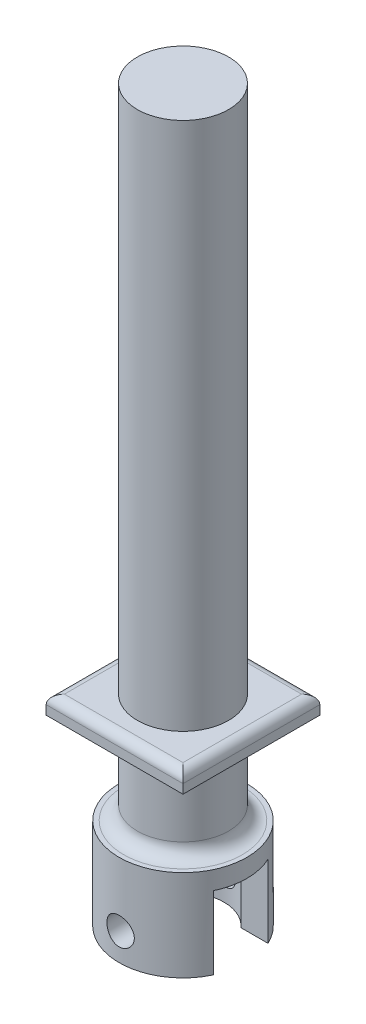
ISO-10303-21;
HEADER;
FILE_DESCRIPTION(('STEP AP214'),'2;1');
FILE_NAME('part.step','',(''),(''),'','','');
FILE_SCHEMA(('AUTOMOTIVE_DESIGN { 1 0 10303 214 1 1 1 1 }'));
ENDSEC;
DATA;
#1=APPLICATION_CONTEXT('core data for automotive mechanical design processes');
#2=APPLICATION_PROTOCOL_DEFINITION('international standard','automotive_design',2000,#1);
#3=PRODUCT_CONTEXT('',#1,'mechanical');
#4=PRODUCT('Part','Part','',(#3));
#5=PRODUCT_RELATED_PRODUCT_CATEGORY('part','',(#4));
#6=PRODUCT_DEFINITION_FORMATION('','',#4);
#7=PRODUCT_DEFINITION_CONTEXT('part definition',#1,'design');
#8=PRODUCT_DEFINITION('design','',#6,#7);
#9=PRODUCT_DEFINITION_SHAPE('','',#8);
#10=(LENGTH_UNIT() NAMED_UNIT(*) SI_UNIT(.MILLI.,.METRE.));
#11=(NAMED_UNIT(*) PLANE_ANGLE_UNIT() SI_UNIT($,.RADIAN.));
#12=(NAMED_UNIT(*) SI_UNIT($,.STERADIAN.) SOLID_ANGLE_UNIT());
#13=UNCERTAINTY_MEASURE_WITH_UNIT(LENGTH_MEASURE(1.E-05),#10,'distance_accuracy_value','');
#14=(GEOMETRIC_REPRESENTATION_CONTEXT(3) GLOBAL_UNCERTAINTY_ASSIGNED_CONTEXT((#13)) GLOBAL_UNIT_ASSIGNED_CONTEXT((#10,
#11,#12)) REPRESENTATION_CONTEXT('',''));
#15=CARTESIAN_POINT('',(0.,0.,0.));
#16=DIRECTION('',(0.,0.,1.));
#17=DIRECTION('',(1.,0.,0.));
#18=AXIS2_PLACEMENT_3D('',#15,#16,#17);
#19=CARTESIAN_POINT('',(0.,6.14499321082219,0.));
#20=DIRECTION('',(0.,-1.,0.));
#21=DIRECTION('',(0.,0.,-1.));
#22=AXIS2_PLACEMENT_3D('',#19,#20,#21);
#23=PLANE('',#22);
#24=DIRECTION('',(-1.,0.,0.));
#25=VECTOR('',#24,1.);
#26=CARTESIAN_POINT('',(-10.9357512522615,6.14499321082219,3.));
#27=LINE('',#26,#25);
#28=CARTESIAN_POINT('',(6.32455532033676,6.14499321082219,3.));
#29=VERTEX_POINT('',#28);
#30=CARTESIAN_POINT('',(3.35410196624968,6.14499321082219,3.));
#31=VERTEX_POINT('',#30);
#32=EDGE_CURVE('E555',#29,#31,#27,.T.);
#33=ORIENTED_EDGE('',*,*,#32,.F.);
#34=CARTESIAN_POINT('',(0.,6.14499321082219,0.));
#35=DIRECTION('',(0.,-1.,0.));
#36=DIRECTION('',(0.,0.,-1.));
#37=AXIS2_PLACEMENT_3D('',#34,#35,#36);
#38=CIRCLE('',#37,7.);
#39=CARTESIAN_POINT('',(-6.32455532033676,6.14499321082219,3.));
#40=VERTEX_POINT('',#39);
#41=EDGE_CURVE('E180',#29,#40,#38,.T.);
#42=ORIENTED_EDGE('',*,*,#41,.T.);
#43=CARTESIAN_POINT('',(-3.35410196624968,6.14499321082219,3.));
#44=VERTEX_POINT('',#43);
#45=EDGE_CURVE('E172',#44,#40,#27,.T.);
#46=ORIENTED_EDGE('',*,*,#45,.F.);
#47=CARTESIAN_POINT('',(0.,6.14499321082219,0.));
#48=DIRECTION('',(0.,-1.,0.));
#49=DIRECTION('',(0.,0.,-1.));
#50=AXIS2_PLACEMENT_3D('',#47,#48,#49);
#51=CIRCLE('',#50,4.5);
#52=EDGE_CURVE('E186',#31,#44,#51,.T.);
#53=ORIENTED_EDGE('',*,*,#52,.F.);
#54=EDGE_LOOP('',(#33,#42,#46,#53));
#55=FACE_BOUND('',#54,.T.);
#56=ADVANCED_FACE('F47',(#55),#23,.T.);
#57=CARTESIAN_POINT('',(0.,86.1449932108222,0.));
#58=DIRECTION('',(0.,1.,0.));
#59=DIRECTION('',(0.,0.,1.));
#60=AXIS2_PLACEMENT_3D('',#57,#58,#59);
#61=CYLINDRICAL_SURFACE('',#60,5.);
#62=CARTESIAN_POINT('',(0.,17.6449932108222,0.));
#63=DIRECTION('',(0.,-1.,0.));
#64=DIRECTION('',(0.,0.,-1.));
#65=AXIS2_PLACEMENT_3D('',#62,#63,#64);
#66=CIRCLE('',#65,5.);
#67=CARTESIAN_POINT('',(0.,17.6449932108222,-5.));
#68=VERTEX_POINT('',#67);
#69=EDGE_CURVE('E221',#68,#68,#66,.F.);
#70=ORIENTED_EDGE('',*,*,#69,.T.);
#71=EDGE_LOOP('',(#70));
#72=FACE_BOUND('',#71,.T.);
#73=CARTESIAN_POINT('',(0.,26.1449932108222,0.));
#74=DIRECTION('',(0.,1.,0.));
#75=DIRECTION('',(0.,0.,1.));
#76=AXIS2_PLACEMENT_3D('',#73,#74,#75);
#77=CIRCLE('',#76,5.);
#78=CARTESIAN_POINT('',(0.,26.1449932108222,5.));
#79=VERTEX_POINT('',#78);
#80=EDGE_CURVE('E215',#79,#79,#77,.T.);
#81=ORIENTED_EDGE('',*,*,#80,.F.);
#82=EDGE_LOOP('',(#81));
#83=FACE_BOUND('',#82,.T.);
#84=ADVANCED_FACE('F286',(#72,#83),#61,.T.);
#85=CARTESIAN_POINT('',(0.,26.1449932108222,0.));
#86=DIRECTION('',(0.,1.,0.));
#87=DIRECTION('',(0.,0.,1.));
#88=AXIS2_PLACEMENT_3D('',#85,#86,#87);
#89=PLANE('',#88);
#90=DIRECTION('',(0.,0.,-1.));
#91=VECTOR('',#90,1.);
#92=CARTESIAN_POINT('',(-7.5,26.1449932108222,7.5));
#93=LINE('',#92,#91);
#94=CARTESIAN_POINT('',(-7.5,26.1449932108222,7.5));
#95=VERTEX_POINT('',#94);
#96=CARTESIAN_POINT('',(-7.5,26.1449932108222,-7.5));
#97=VERTEX_POINT('',#96);
#98=EDGE_CURVE('E194',#95,#97,#93,.T.);
#99=ORIENTED_EDGE('',*,*,#98,.T.);
#100=DIRECTION('',(1.,0.,0.));
#101=VECTOR('',#100,1.);
#102=CARTESIAN_POINT('',(7.5,26.1449932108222,-7.5));
#103=LINE('',#102,#101);
#104=CARTESIAN_POINT('',(7.5,26.1449932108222,-7.5));
#105=VERTEX_POINT('',#104);
#106=EDGE_CURVE('E197',#97,#105,#103,.T.);
#107=ORIENTED_EDGE('',*,*,#106,.T.);
#108=DIRECTION('',(0.,0.,1.));
#109=VECTOR('',#108,1.);
#110=CARTESIAN_POINT('',(7.5,26.1449932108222,7.5));
#111=LINE('',#110,#109);
#112=CARTESIAN_POINT('',(7.5,26.1449932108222,7.5));
#113=VERTEX_POINT('',#112);
#114=EDGE_CURVE('E199',#105,#113,#111,.T.);
#115=ORIENTED_EDGE('',*,*,#114,.T.);
#116=DIRECTION('',(-1.,0.,0.));
#117=VECTOR('',#116,1.);
#118=CARTESIAN_POINT('',(7.5,26.1449932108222,7.5));
#119=LINE('',#118,#117);
#120=EDGE_CURVE('E201',#113,#95,#119,.T.);
#121=ORIENTED_EDGE('',*,*,#120,.T.);
#122=EDGE_LOOP('',(#99,#107,#115,#121));
#123=FACE_BOUND('',#122,.T.);
#124=ORIENTED_EDGE('',*,*,#80,.T.);
#125=EDGE_LOOP('',(#124));
#126=FACE_BOUND('',#125,.T.);
#127=ADVANCED_FACE('F281',(#123,#126),#89,.F.);
#128=CARTESIAN_POINT('',(0.,28.1449932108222,0.));
#129=DIRECTION('',(0.,1.,0.));
#130=DIRECTION('',(0.,0.,1.));
#131=AXIS2_PLACEMENT_3D('',#128,#129,#130);
#132=PLANE('',#131);
#133=DIRECTION('',(1.,0.,0.));
#134=VECTOR('',#133,1.);
#135=CARTESIAN_POINT('',(-7.5,28.1449932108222,-6.5));
#136=LINE('',#135,#134);
#137=CARTESIAN_POINT('',(6.5,28.1449932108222,-6.5));
#138=VERTEX_POINT('',#137);
#139=CARTESIAN_POINT('',(-6.5,28.1449932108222,-6.5));
#140=VERTEX_POINT('',#139);
#141=EDGE_CURVE('E601',#138,#140,#136,.F.);
#142=ORIENTED_EDGE('',*,*,#141,.T.);
#143=DIRECTION('',(0.,0.,-1.));
#144=VECTOR('',#143,1.);
#145=CARTESIAN_POINT('',(-6.5,28.1449932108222,7.5));
#146=LINE('',#145,#144);
#147=CARTESIAN_POINT('',(-6.5,28.1449932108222,6.5));
#148=VERTEX_POINT('',#147);
#149=EDGE_CURVE('E599',#140,#148,#146,.F.);
#150=ORIENTED_EDGE('',*,*,#149,.T.);
#151=DIRECTION('',(-1.,0.,0.));
#152=VECTOR('',#151,1.);
#153=CARTESIAN_POINT('',(7.5,28.1449932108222,6.5));
#154=LINE('',#153,#152);
#155=CARTESIAN_POINT('',(6.5,28.1449932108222,6.5));
#156=VERTEX_POINT('',#155);
#157=EDGE_CURVE('E585',#148,#156,#154,.F.);
#158=ORIENTED_EDGE('',*,*,#157,.T.);
#159=DIRECTION('',(0.,0.,1.));
#160=VECTOR('',#159,1.);
#161=CARTESIAN_POINT('',(6.5,28.1449932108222,-7.5));
#162=LINE('',#161,#160);
#163=EDGE_CURVE('E603',#156,#138,#162,.F.);
#164=ORIENTED_EDGE('',*,*,#163,.T.);
#165=EDGE_LOOP('',(#142,#150,#158,#164));
#166=FACE_BOUND('',#165,.T.);
#167=CARTESIAN_POINT('',(0.,28.1449932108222,0.));
#168=DIRECTION('',(0.,-1.,0.));
#169=DIRECTION('',(0.,0.,-1.));
#170=AXIS2_PLACEMENT_3D('',#167,#168,#169);
#171=CIRCLE('',#170,5.00000000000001);
#172=CARTESIAN_POINT('',(0.,28.1449932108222,-5.00000000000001));
#173=VERTEX_POINT('',#172);
#174=EDGE_CURVE('E184',#173,#173,#171,.T.);
#175=ORIENTED_EDGE('',*,*,#174,.T.);
#176=EDGE_LOOP('',(#175));
#177=FACE_BOUND('',#176,.T.);
#178=ADVANCED_FACE('F285',(#166,#177),#132,.T.);
#179=CARTESIAN_POINT('',(-7.5,26.1449932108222,7.5));
#180=DIRECTION('',(1.,0.,0.));
#181=DIRECTION('',(0.,0.,-1.));
#182=AXIS2_PLACEMENT_3D('',#179,#180,#181);
#183=PLANE('',#182);
#184=DIRECTION('',(0.,1.,0.));
#185=VECTOR('',#184,1.);
#186=CARTESIAN_POINT('',(-7.5,26.1449932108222,7.5));
#187=LINE('',#186,#185);
#188=CARTESIAN_POINT('',(-7.5,27.1449932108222,7.5));
#189=VERTEX_POINT('',#188);
#190=EDGE_CURVE('E203',#95,#189,#187,.T.);
#191=ORIENTED_EDGE('',*,*,#190,.T.);
#192=DIRECTION('',(0.,0.,-1.));
#193=VECTOR('',#192,1.);
#194=CARTESIAN_POINT('',(-7.5,27.1449932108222,-7.5));
#195=LINE('',#194,#193);
#196=CARTESIAN_POINT('',(-7.5,27.1449932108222,-7.5));
#197=VERTEX_POINT('',#196);
#198=EDGE_CURVE('E237',#189,#197,#195,.T.);
#199=ORIENTED_EDGE('',*,*,#198,.T.);
#200=DIRECTION('',(0.,1.,0.));
#201=VECTOR('',#200,1.);
#202=CARTESIAN_POINT('',(-7.5,26.1449932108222,-7.5));
#203=LINE('',#202,#201);
#204=EDGE_CURVE('E210',#97,#197,#203,.T.);
#205=ORIENTED_EDGE('',*,*,#204,.F.);
#206=ORIENTED_EDGE('',*,*,#98,.F.);
#207=EDGE_LOOP('',(#191,#199,#205,#206));
#208=FACE_BOUND('',#207,.T.);
#209=ADVANCED_FACE('F290',(#208),#183,.F.);
#210=CARTESIAN_POINT('',(7.5,26.1449932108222,-7.5));
#211=DIRECTION('',(0.,0.,1.));
#212=DIRECTION('',(1.,0.,0.));
#213=AXIS2_PLACEMENT_3D('',#210,#211,#212);
#214=PLANE('',#213);
#215=ORIENTED_EDGE('',*,*,#204,.T.);
#216=DIRECTION('',(1.,0.,0.));
#217=VECTOR('',#216,1.);
#218=CARTESIAN_POINT('',(7.5,27.1449932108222,-7.5));
#219=LINE('',#218,#217);
#220=CARTESIAN_POINT('',(7.5,27.1449932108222,-7.5));
#221=VERTEX_POINT('',#220);
#222=EDGE_CURVE('E71',#197,#221,#219,.T.);
#223=ORIENTED_EDGE('',*,*,#222,.T.);
#224=DIRECTION('',(0.,1.,0.));
#225=VECTOR('',#224,1.);
#226=CARTESIAN_POINT('',(7.5,26.1449932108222,-7.5));
#227=LINE('',#226,#225);
#228=EDGE_CURVE('E208',#105,#221,#227,.T.);
#229=ORIENTED_EDGE('',*,*,#228,.F.);
#230=ORIENTED_EDGE('',*,*,#106,.F.);
#231=EDGE_LOOP('',(#215,#223,#229,#230));
#232=FACE_BOUND('',#231,.T.);
#233=ADVANCED_FACE('F300',(#232),#214,.F.);
#234=CARTESIAN_POINT('',(7.5,26.1449932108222,7.5));
#235=DIRECTION('',(-1.,0.,0.));
#236=DIRECTION('',(0.,0.,1.));
#237=AXIS2_PLACEMENT_3D('',#234,#235,#236);
#238=PLANE('',#237);
#239=ORIENTED_EDGE('',*,*,#228,.T.);
#240=DIRECTION('',(0.,0.,1.));
#241=VECTOR('',#240,1.);
#242=CARTESIAN_POINT('',(7.5,27.1449932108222,7.5));
#243=LINE('',#242,#241);
#244=CARTESIAN_POINT('',(7.5,27.1449932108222,7.5));
#245=VERTEX_POINT('',#244);
#246=EDGE_CURVE('E56',#221,#245,#243,.T.);
#247=ORIENTED_EDGE('',*,*,#246,.T.);
#248=DIRECTION('',(0.,1.,0.));
#249=VECTOR('',#248,1.);
#250=CARTESIAN_POINT('',(7.5,26.1449932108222,7.5));
#251=LINE('',#250,#249);
#252=EDGE_CURVE('E206',#113,#245,#251,.T.);
#253=ORIENTED_EDGE('',*,*,#252,.F.);
#254=ORIENTED_EDGE('',*,*,#114,.F.);
#255=EDGE_LOOP('',(#239,#247,#253,#254));
#256=FACE_BOUND('',#255,.T.);
#257=ADVANCED_FACE('F296',(#256),#238,.F.);
#258=CARTESIAN_POINT('',(7.5,26.1449932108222,7.5));
#259=DIRECTION('',(0.,0.,-1.));
#260=DIRECTION('',(-1.,0.,0.));
#261=AXIS2_PLACEMENT_3D('',#258,#259,#260);
#262=PLANE('',#261);
#263=ORIENTED_EDGE('',*,*,#252,.T.);
#264=DIRECTION('',(-1.,0.,0.));
#265=VECTOR('',#264,1.);
#266=CARTESIAN_POINT('',(-7.5,27.1449932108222,7.5));
#267=LINE('',#266,#265);
#268=EDGE_CURVE('E12',#245,#189,#267,.T.);
#269=ORIENTED_EDGE('',*,*,#268,.T.);
#270=ORIENTED_EDGE('',*,*,#190,.F.);
#271=ORIENTED_EDGE('',*,*,#120,.F.);
#272=EDGE_LOOP('',(#263,#269,#270,#271));
#273=FACE_BOUND('',#272,.T.);
#274=ADVANCED_FACE('F292',(#273),#262,.F.);
#275=CARTESIAN_POINT('',(5.,86.1449932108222,0.));
#276=DIRECTION('',(0.,-1.,0.));
#277=DIRECTION('',(0.,0.,-1.));
#278=AXIS2_PLACEMENT_3D('',#275,#276,#277);
#279=PLANE('',#278);
#280=CARTESIAN_POINT('',(0.,86.1449932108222,0.));
#281=DIRECTION('',(0.,1.,0.));
#282=DIRECTION('',(0.,0.,1.));
#283=AXIS2_PLACEMENT_3D('',#280,#281,#282);
#284=CIRCLE('',#283,5.);
#285=CARTESIAN_POINT('',(0.,86.1449932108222,5.));
#286=VERTEX_POINT('',#285);
#287=EDGE_CURVE('E212',#286,#286,#284,.T.);
#288=ORIENTED_EDGE('',*,*,#287,.T.);
#289=EDGE_LOOP('',(#288));
#290=FACE_BOUND('',#289,.T.);
#291=ADVANCED_FACE('F295',(#290),#279,.F.);
#292=ORIENTED_EDGE('',*,*,#174,.F.);
#293=EDGE_LOOP('',(#292));
#294=FACE_BOUND('',#293,.T.);
#295=ORIENTED_EDGE('',*,*,#287,.F.);
#296=EDGE_LOOP('',(#295));
#297=FACE_BOUND('',#296,.T.);
#298=ADVANCED_FACE('F306',(#294,#297),#61,.T.);
#299=CARTESIAN_POINT('',(0.,16.1449932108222,0.));
#300=DIRECTION('',(0.,-1.,0.));
#301=DIRECTION('',(0.,0.,-1.));
#302=AXIS2_PLACEMENT_3D('',#299,#300,#301);
#303=PLANE('',#302);
#304=CARTESIAN_POINT('',(0.,16.1449932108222,0.));
#305=DIRECTION('',(0.,-1.,0.));
#306=DIRECTION('',(0.,0.,-1.));
#307=AXIS2_PLACEMENT_3D('',#304,#305,#306);
#308=CIRCLE('',#307,6.5);
#309=CARTESIAN_POINT('',(0.,16.1449932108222,-6.5));
#310=VERTEX_POINT('',#309);
#311=EDGE_CURVE('E218',#310,#310,#308,.T.);
#312=ORIENTED_EDGE('',*,*,#311,.T.);
#313=EDGE_LOOP('',(#312));
#314=FACE_BOUND('',#313,.T.);
#315=CARTESIAN_POINT('',(0.,16.1449932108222,0.));
#316=DIRECTION('',(0.,-1.,0.));
#317=DIRECTION('',(0.,0.,-1.));
#318=AXIS2_PLACEMENT_3D('',#315,#316,#317);
#319=CIRCLE('',#318,7.);
#320=CARTESIAN_POINT('',(0.,16.1449932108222,-7.));
#321=VERTEX_POINT('',#320);
#322=EDGE_CURVE('E181',#321,#321,#319,.T.);
#323=ORIENTED_EDGE('',*,*,#322,.F.);
#324=EDGE_LOOP('',(#323));
#325=FACE_BOUND('',#324,.T.);
#326=ADVANCED_FACE('F280',(#314,#325),#303,.F.);
#327=DIRECTION('',(1.,0.,0.));
#328=VECTOR('',#327,1.);
#329=CARTESIAN_POINT('',(-10.9357512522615,6.14499321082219,-3.));
#330=LINE('',#329,#328);
#331=CARTESIAN_POINT('',(-6.32455532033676,6.14499321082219,-3.));
#332=VERTEX_POINT('',#331);
#333=CARTESIAN_POINT('',(-3.35410196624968,6.14499321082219,-3.));
#334=VERTEX_POINT('',#333);
#335=EDGE_CURVE('E155',#332,#334,#330,.T.);
#336=ORIENTED_EDGE('',*,*,#335,.F.);
#337=CARTESIAN_POINT('',(6.32455532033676,6.14499321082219,-3.));
#338=VERTEX_POINT('',#337);
#339=EDGE_CURVE('E169',#332,#338,#38,.T.);
#340=ORIENTED_EDGE('',*,*,#339,.T.);
#341=CARTESIAN_POINT('',(3.35410196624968,6.14499321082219,-3.));
#342=VERTEX_POINT('',#341);
#343=EDGE_CURVE('E173',#342,#338,#330,.T.);
#344=ORIENTED_EDGE('',*,*,#343,.F.);
#345=EDGE_CURVE('E171',#334,#342,#51,.T.);
#346=ORIENTED_EDGE('',*,*,#345,.F.);
#347=EDGE_LOOP('',(#336,#340,#344,#346));
#348=FACE_BOUND('',#347,.T.);
#349=ADVANCED_FACE('F167',(#348),#23,.T.);
#350=CARTESIAN_POINT('',(0.,6.14499321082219,0.));
#351=DIRECTION('',(0.,1.,0.));
#352=DIRECTION('',(0.,0.,1.));
#353=AXIS2_PLACEMENT_3D('',#350,#351,#352);
#354=CYLINDRICAL_SURFACE('',#353,7.);
#355=CARTESIAN_POINT('',(0.,7.64499321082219,7.));
#356=CARTESIAN_POINT('',(-0.0832358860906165,7.64499611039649,6.99999846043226));
#357=CARTESIAN_POINT('',(-0.166507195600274,7.65194481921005,6.99850025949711));
#358=CARTESIAN_POINT('',(-0.330687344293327,7.67952886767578,6.99266829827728));
#359=CARTESIAN_POINT('',(-0.41159440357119,7.70017425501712,6.988332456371));
#360=CARTESIAN_POINT('',(-0.568649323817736,7.75447757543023,6.97730831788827));
#361=CARTESIAN_POINT('',(-0.644801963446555,7.78812219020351,6.97062242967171));
#362=CARTESIAN_POINT('',(-0.790378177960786,7.86742729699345,6.95562106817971));
#363=CARTESIAN_POINT('',(-0.859801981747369,7.91308738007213,6.94730565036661));
#364=CARTESIAN_POINT('',(-0.991024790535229,8.0158735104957,6.92981369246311));
#365=CARTESIAN_POINT('',(-1.05270503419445,8.07314943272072,6.92062683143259));
#366=CARTESIAN_POINT('',(-1.16566042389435,8.19721952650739,6.90250069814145));
#367=CARTESIAN_POINT('',(-1.21693467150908,8.26401451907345,6.8935614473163));
#368=CARTESIAN_POINT('',(-1.30814204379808,8.40609896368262,6.87684116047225));
#369=CARTESIAN_POINT('',(-1.34794958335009,8.4814707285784,6.8690733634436));
#370=CARTESIAN_POINT('',(-1.41428823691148,8.63802766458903,6.85572325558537));
#371=CARTESIAN_POINT('',(-1.44082087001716,8.71921216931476,6.85014069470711));
#372=CARTESIAN_POINT('',(-1.47946574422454,8.88380429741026,6.84189808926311));
#373=CARTESIAN_POINT('',(-1.49178779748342,8.96716048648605,6.83919556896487));
#374=CARTESIAN_POINT('',(-1.50231395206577,9.13479744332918,6.83689139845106));
#375=CARTESIAN_POINT('',(-1.50051971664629,9.21907810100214,6.83728938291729));
#376=CARTESIAN_POINT('',(-1.48303326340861,9.38461789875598,6.84110276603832));
#377=CARTESIAN_POINT('',(-1.46758398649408,9.46590409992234,6.84446541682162));
#378=CARTESIAN_POINT('',(-1.42361054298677,9.62470345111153,6.85374593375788));
#379=CARTESIAN_POINT('',(-1.39508566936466,9.70221639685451,6.85966393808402));
#380=CARTESIAN_POINT('',(-1.32554551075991,9.85195608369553,6.87344080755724));
#381=CARTESIAN_POINT('',(-1.2844361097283,9.92413772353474,6.88131420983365));
#382=CARTESIAN_POINT('',(-1.19096007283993,10.0606683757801,6.89810572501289));
#383=CARTESIAN_POINT('',(-1.13859196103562,10.1250163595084,6.90702397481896));
#384=CARTESIAN_POINT('',(-1.0227954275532,10.2454525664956,6.92512718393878));
#385=CARTESIAN_POINT('',(-0.959160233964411,10.3013419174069,6.93431383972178));
#386=CARTESIAN_POINT('',(-0.823317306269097,10.4016869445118,6.9517501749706));
#387=CARTESIAN_POINT('',(-0.751109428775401,10.4461424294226,6.95999983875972));
#388=CARTESIAN_POINT('',(-0.59993346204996,10.5224038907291,6.97465778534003));
#389=CARTESIAN_POINT('',(-0.520952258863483,10.5541846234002,6.98106238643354));
#390=CARTESIAN_POINT('',(-0.358603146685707,10.6039688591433,6.99128109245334));
#391=CARTESIAN_POINT('',(-0.27523585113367,10.6219742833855,6.99509555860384));
#392=CARTESIAN_POINT('',(-0.10818767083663,10.6434094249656,6.99965306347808));
#393=CARTESIAN_POINT('',(-0.0245431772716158,10.647110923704,7.00045336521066));
#394=CARTESIAN_POINT('',(0.142168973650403,10.640568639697,6.9990524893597));
#395=CARTESIAN_POINT('',(0.225236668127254,10.6303257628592,6.99685150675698));
#396=CARTESIAN_POINT('',(0.387542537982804,10.5964109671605,6.98973143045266));
#397=CARTESIAN_POINT('',(0.466811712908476,10.5728808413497,6.9848410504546));
#398=CARTESIAN_POINT('',(0.620278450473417,10.5132162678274,6.9728892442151));
#399=CARTESIAN_POINT('',(0.694475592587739,10.4770807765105,6.96582763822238));
#400=CARTESIAN_POINT('',(0.836821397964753,10.3926596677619,6.950175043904));
#401=CARTESIAN_POINT('',(0.90487257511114,10.3442134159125,6.94156431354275));
#402=CARTESIAN_POINT('',(1.03197692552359,10.2367583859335,6.92381033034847));
#403=CARTESIAN_POINT('',(1.091028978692,10.1777482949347,6.91466701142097));
#404=CARTESIAN_POINT('',(1.19952711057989,10.0495958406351,6.89668172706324));
#405=CARTESIAN_POINT('',(1.24878537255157,9.98029311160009,6.88784792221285));
#406=CARTESIAN_POINT('',(1.3349641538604,9.8342386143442,6.87166654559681));
#407=CARTESIAN_POINT('',(1.37188519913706,9.7574871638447,6.86431891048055));
#408=CARTESIAN_POINT('',(1.43209741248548,9.59912091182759,6.85201009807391));
#409=CARTESIAN_POINT('',(1.45546398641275,9.51753585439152,6.84703574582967));
#410=CARTESIAN_POINT('',(1.48812696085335,9.35147762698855,6.84001186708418));
#411=CARTESIAN_POINT('',(1.49742550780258,9.26700489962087,6.83796189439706));
#412=CARTESIAN_POINT('',(1.5015999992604,9.09946086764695,6.83704618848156));
#413=CARTESIAN_POINT('',(1.49677347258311,9.01639719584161,6.83811476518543));
#414=CARTESIAN_POINT('',(1.47349789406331,8.8522959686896,6.84316763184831));
#415=CARTESIAN_POINT('',(1.45504898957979,8.77125839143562,6.84715189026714));
#416=CARTESIAN_POINT('',(1.40519345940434,8.61373455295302,6.85755581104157));
#417=CARTESIAN_POINT('',(1.37382847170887,8.5372345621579,6.86396764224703));
#418=CARTESIAN_POINT('',(1.29906751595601,8.39053783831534,6.87850764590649));
#419=CARTESIAN_POINT('',(1.255670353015,8.32034173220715,6.88663598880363));
#420=CARTESIAN_POINT('',(1.15708290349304,8.18677501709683,6.90389055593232));
#421=CARTESIAN_POINT('',(1.10167987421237,8.12356351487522,6.91303309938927));
#422=CARTESIAN_POINT('',(0.981086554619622,8.00723694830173,6.93117449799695));
#423=CARTESIAN_POINT('',(0.915894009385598,7.95412421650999,6.94017331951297));
#424=CARTESIAN_POINT('',(0.776603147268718,7.85887725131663,6.95714491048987));
#425=CARTESIAN_POINT('',(0.702404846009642,7.81688660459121,6.96510364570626));
#426=CARTESIAN_POINT('',(0.547850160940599,7.74603868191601,6.97895826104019));
#427=CARTESIAN_POINT('',(0.467499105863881,7.71717018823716,6.98485590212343));
#428=CARTESIAN_POINT('',(0.322535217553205,7.67864102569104,6.99284848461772));
#429=CARTESIAN_POINT('',(0.25871720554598,7.66604677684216,6.99551391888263));
#430=CARTESIAN_POINT('',(0.129939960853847,7.64922190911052,6.9990902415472));
#431=CARTESIAN_POINT('',(0.0649807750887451,7.64499094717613,7.00000120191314));
#432=CARTESIAN_POINT('',(0.,7.64499321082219,7.));
#433=B_SPLINE_CURVE_WITH_KNOTS('',3,(#355,#356,#357,#358,#359,#360,#361,#362,#363,#364,#365,
#366,#367,#368,#369,#370,#371,#372,#373,#374,#375,#376,#377,#378,#379,#380,#381,#382,#383,#384,
#385,#386,#387,#388,#389,#390,#391,#392,#393,#394,#395,#396,#397,#398,#399,#400,#401,#402,#403,
#404,#405,#406,#407,#408,#409,#410,#411,#412,#413,#414,#415,#416,#417,#418,#419,#420,#421,#422,
#423,#424,#425,#426,#427,#428,#429,#430,#431,#432),.UNSPECIFIED.,.T.,.F.,(4,2,2,2,2,2,2,2,2,2,2,
2,2,2,2,2,2,2,2,2,2,2,2,2,2,2,2,2,2,2,2,2,2,2,2,2,2,2,4),(0.,0.249469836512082,
0.499122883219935,0.748520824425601,0.997910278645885,1.25074961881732,1.50361077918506,
1.7591442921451,2.0146485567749,2.26633008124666,2.51798195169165,2.76524475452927,
3.01252092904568,3.26169356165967,3.51089887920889,3.76527011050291,4.0196455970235,
4.27452521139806,4.52936927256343,4.77934665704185,5.02930780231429,5.27665060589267,
5.52401389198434,5.77478733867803,6.02559197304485,6.28082063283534,6.53603841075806,
6.78982240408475,7.04356767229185,7.29200680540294,7.5404432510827,7.78808499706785,
8.03575134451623,8.28822950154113,8.54076590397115,8.79641910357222,9.05185334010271,
9.24661799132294,9.44137465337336),.UNSPECIFIED.);
#434=CARTESIAN_POINT('',(0.,7.64499321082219,7.));
#435=VERTEX_POINT('',#434);
#436=EDGE_CURVE('E271',#435,#435,#433,.T.);
#437=ORIENTED_EDGE('',*,*,#436,.T.);
#438=EDGE_LOOP('',(#437));
#439=FACE_BOUND('',#438,.T.);
#440=CARTESIAN_POINT('',(1.5,9.14499321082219,-6.83739716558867));
#441=CARTESIAN_POINT('',(1.49999708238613,9.22820436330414,-6.83739884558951));
#442=CARTESIAN_POINT('',(1.49305236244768,9.31145098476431,-6.83893272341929));
#443=CARTESIAN_POINT('',(1.46548559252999,9.4755798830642,-6.84489178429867));
#444=CARTESIAN_POINT('',(1.44485339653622,9.5564603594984,-6.84931911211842));
#445=CARTESIAN_POINT('',(1.39058863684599,9.71345896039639,-6.86054115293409));
#446=CARTESIAN_POINT('',(1.35697000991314,9.78958208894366,-6.86733332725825));
#447=CARTESIAN_POINT('',(1.27772617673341,9.9351084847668,-6.88251670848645));
#448=CARTESIAN_POINT('',(1.23210132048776,10.0045119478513,-6.89090786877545));
#449=CARTESIAN_POINT('',(1.12935142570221,10.1357561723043,-6.90849578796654));
#450=CARTESIAN_POINT('',(1.07206859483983,10.1974720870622,-6.91770249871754));
#451=CARTESIAN_POINT('',(0.947969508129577,10.310496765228,-6.93579691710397));
#452=CARTESIAN_POINT('',(0.881152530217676,10.3618047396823,-6.94468460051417));
#453=CARTESIAN_POINT('',(0.739047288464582,10.4530486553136,-6.96124769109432));
#454=CARTESIAN_POINT('',(0.663680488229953,10.4928648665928,-6.96890998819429));
#455=CARTESIAN_POINT('',(0.507134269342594,10.5592209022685,-6.98204671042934));
#456=CARTESIAN_POINT('',(0.425955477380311,10.5857621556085,-6.98752137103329));
#457=CARTESIAN_POINT('',(0.261387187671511,10.6244231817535,-6.99559565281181));
#458=CARTESIAN_POINT('',(0.178049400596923,10.6367541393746,-6.99823733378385));
#459=CARTESIAN_POINT('',(0.0104489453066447,10.6473044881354,-7.00049362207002));
#460=CARTESIAN_POINT('',(-0.0738136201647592,10.6455254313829,-7.00010856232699));
#461=CARTESIAN_POINT('',(-0.239417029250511,10.6280642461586,-6.99638700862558));
#462=CARTESIAN_POINT('',(-0.320783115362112,10.6126097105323,-6.99309883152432));
#463=CARTESIAN_POINT('',(-0.479739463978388,10.5685985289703,-6.98399541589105));
#464=CARTESIAN_POINT('',(-0.557329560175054,10.5400413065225,-6.97818006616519));
#465=CARTESIAN_POINT('',(-0.707167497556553,10.4704317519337,-6.96459754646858));
#466=CARTESIAN_POINT('',(-0.779373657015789,10.4292924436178,-6.95681685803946));
#467=CARTESIAN_POINT('',(-0.915940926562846,10.3357512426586,-6.94015793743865));
#468=CARTESIAN_POINT('',(-0.980301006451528,10.2833478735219,-6.93127956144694));
#469=CARTESIAN_POINT('',(-1.10070208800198,10.1675246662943,-6.91319326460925));
#470=CARTESIAN_POINT('',(-1.1565511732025,10.1039056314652,-6.90398230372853));
#471=CARTESIAN_POINT('',(-1.25682243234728,9.96810992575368,-6.88643566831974));
#472=CARTESIAN_POINT('',(-1.30124432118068,9.89593304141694,-6.87810001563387));
#473=CARTESIAN_POINT('',(-1.37748077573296,9.74476870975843,-6.86324023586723));
#474=CARTESIAN_POINT('',(-1.40926035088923,9.66576308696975,-6.85672115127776));
#475=CARTESIAN_POINT('',(-1.45903495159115,9.50336044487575,-6.84630340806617));
#476=CARTESIAN_POINT('',(-1.47703206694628,9.419964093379,-6.84240435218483));
#477=CARTESIAN_POINT('',(-1.49843586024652,9.25289745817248,-6.83774881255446));
#478=CARTESIAN_POINT('',(-1.5021214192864,9.16926453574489,-6.83693227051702));
#479=CARTESIAN_POINT('',(-1.49555139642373,9.0025792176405,-6.83837239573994));
#480=CARTESIAN_POINT('',(-1.48529673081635,8.91952678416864,-6.84062886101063));
#481=CARTESIAN_POINT('',(-1.45137894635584,8.75732277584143,-6.84790415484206));
#482=CARTESIAN_POINT('',(-1.42786830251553,8.67813777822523,-6.85289155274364));
#483=CARTESIAN_POINT('',(-1.36827052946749,8.52483087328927,-6.86503859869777));
#484=CARTESIAN_POINT('',(-1.33218223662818,8.450709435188,-6.87219844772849));
#485=CARTESIAN_POINT('',(-1.24783504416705,8.30842352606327,-6.88801634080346));
#486=CARTESIAN_POINT('',(-1.19940368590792,8.24036362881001,-6.89669501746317));
#487=CARTESIAN_POINT('',(-1.09197183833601,8.11323486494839,-6.91451775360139));
#488=CARTESIAN_POINT('',(-1.03297009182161,8.05416706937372,-6.92366186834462));
#489=CARTESIAN_POINT('',(-0.904812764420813,7.94562290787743,-6.94158239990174));
#490=CARTESIAN_POINT('',(-0.83549492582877,7.89633629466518,-6.95034935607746));
#491=CARTESIAN_POINT('',(-0.689401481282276,7.81010780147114,-6.96635610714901));
#492=CARTESIAN_POINT('',(-0.61262621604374,7.77316535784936,-6.97359597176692));
#493=CARTESIAN_POINT('',(-0.454265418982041,7.71294115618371,-6.98569278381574));
#494=CARTESIAN_POINT('',(-0.372713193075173,7.68957490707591,-6.99056443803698));
#495=CARTESIAN_POINT('',(-0.20672517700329,7.65690150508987,-6.99743939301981));
#496=CARTESIAN_POINT('',(-0.122289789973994,7.64759239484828,-6.99944309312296));
#497=CARTESIAN_POINT('',(0.0452637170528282,7.64338255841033,-7.00034511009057));
#498=CARTESIAN_POINT('',(0.128374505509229,7.64819805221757,-6.99930459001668));
#499=CARTESIAN_POINT('',(0.29257293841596,7.67146797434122,-6.99436552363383));
#500=CARTESIAN_POINT('',(0.373660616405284,7.68992217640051,-6.99046702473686));
#501=CARTESIAN_POINT('',(0.531301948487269,7.73981201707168,-6.98025388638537));
#502=CARTESIAN_POINT('',(0.607868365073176,7.77120890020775,-6.97394646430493));
#503=CARTESIAN_POINT('',(0.754684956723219,7.84605448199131,-6.95959036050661));
#504=CARTESIAN_POINT('',(0.824934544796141,7.88950429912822,-6.95154151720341));
#505=CARTESIAN_POINT('',(0.958512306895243,7.98815552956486,-6.93439809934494));
#506=CARTESIAN_POINT('',(1.02169036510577,8.0435573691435,-6.92528708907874));
#507=CARTESIAN_POINT('',(1.13795001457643,8.16413382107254,-6.90713690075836));
#508=CARTESIAN_POINT('',(1.19102918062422,8.2293107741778,-6.89809774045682));
#509=CARTESIAN_POINT('',(1.28623261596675,8.36858370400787,-6.88098693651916));
#510=CARTESIAN_POINT('',(1.32820897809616,8.44278256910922,-6.87292905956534));
#511=CARTESIAN_POINT('',(1.39903004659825,8.59733693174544,-6.85886497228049));
#512=CARTESIAN_POINT('',(1.42788606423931,8.67768705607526,-6.85285699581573));
#513=CARTESIAN_POINT('',(1.46638607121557,8.82261934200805,-6.84470560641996));
#514=CARTESIAN_POINT('',(1.47896752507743,8.88640488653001,-6.84198283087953));
#515=CARTESIAN_POINT('',(1.49577544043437,9.01511752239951,-6.83832799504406));
#516=CARTESIAN_POINT('',(1.50000227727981,9.08004456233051,-6.8373958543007));
#517=CARTESIAN_POINT('',(1.5,9.14499321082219,-6.83739716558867));
#518=B_SPLINE_CURVE_WITH_KNOTS('',3,(#440,#441,#442,#443,#444,#445,#446,#447,#448,#449,#450,
#451,#452,#453,#454,#455,#456,#457,#458,#459,#460,#461,#462,#463,#464,#465,#466,#467,#468,#469,
#470,#471,#472,#473,#474,#475,#476,#477,#478,#479,#480,#481,#482,#483,#484,#485,#486,#487,#488,
#489,#490,#491,#492,#493,#494,#495,#496,#497,#498,#499,#500,#501,#502,#503,#504,#505,#506,#507,
#508,#509,#510,#511,#512,#513,#514,#515,#516,#517),.UNSPECIFIED.,.T.,.F.,(4,2,2,2,2,2,2,2,2,2,2,
2,2,2,2,2,2,2,2,2,2,2,2,2,2,2,2,2,2,2,2,2,2,2,2,2,2,2,4),(0.,0.249395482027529,
0.498976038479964,0.748289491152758,0.997595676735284,1.25053229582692,1.50348808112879,
1.75899134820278,2.01446710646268,2.26609508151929,2.51769537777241,2.76518557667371,
3.01268666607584,3.26193888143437,3.51122378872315,3.76548960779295,4.01976177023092,
4.27473287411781,4.52966530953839,4.77960433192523,5.02952692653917,5.27663180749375,
5.5237595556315,5.77455010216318,6.02537049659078,6.2806621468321,6.53594213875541,
6.78961589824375,7.04325433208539,7.29183199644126,7.54040553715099,7.78824009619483,
8.03609766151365,8.28848914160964,8.54094115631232,8.79660380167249,9.05204561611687,
9.24671456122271,9.44137476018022),.UNSPECIFIED.);
#519=CARTESIAN_POINT('',(1.5,9.14499321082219,-6.83739716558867));
#520=VERTEX_POINT('',#519);
#521=EDGE_CURVE('E266',#520,#520,#518,.T.);
#522=ORIENTED_EDGE('',*,*,#521,.T.);
#523=EDGE_LOOP('',(#522));
#524=FACE_BOUND('',#523,.T.);
#525=ORIENTED_EDGE('',*,*,#41,.F.);
#526=DIRECTION('',(0.,1.,0.));
#527=VECTOR('',#526,1.);
#528=CARTESIAN_POINT('',(6.32455532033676,6.14499321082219,3.));
#529=LINE('',#528,#527);
#530=CARTESIAN_POINT('',(6.32455532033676,14.1449932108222,3.));
#531=VERTEX_POINT('',#530);
#532=EDGE_CURVE('E544',#29,#531,#529,.T.);
#533=ORIENTED_EDGE('',*,*,#532,.T.);
#534=CARTESIAN_POINT('',(0.,14.1449932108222,0.));
#535=DIRECTION('',(0.,-1.,0.));
#536=DIRECTION('',(0.,0.,-1.));
#537=AXIS2_PLACEMENT_3D('',#534,#535,#536);
#538=CIRCLE('',#537,7.);
#539=CARTESIAN_POINT('',(6.32455532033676,14.1449932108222,-3.));
#540=VERTEX_POINT('',#539);
#541=EDGE_CURVE('E551',#540,#531,#538,.T.);
#542=ORIENTED_EDGE('',*,*,#541,.F.);
#543=DIRECTION('',(0.,1.,0.));
#544=VECTOR('',#543,1.);
#545=CARTESIAN_POINT('',(6.32455532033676,6.14499321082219,-3.));
#546=LINE('',#545,#544);
#547=EDGE_CURVE('E162',#540,#338,#546,.F.);
#548=ORIENTED_EDGE('',*,*,#547,.T.);
#549=ORIENTED_EDGE('',*,*,#339,.F.);
#550=DIRECTION('',(0.,1.,0.));
#551=VECTOR('',#550,1.);
#552=CARTESIAN_POINT('',(-6.32455532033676,6.14499321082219,-3.));
#553=LINE('',#552,#551);
#554=CARTESIAN_POINT('',(-6.32455532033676,14.1449932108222,-3.));
#555=VERTEX_POINT('',#554);
#556=EDGE_CURVE('E151',#332,#555,#553,.T.);
#557=ORIENTED_EDGE('',*,*,#556,.T.);
#558=CARTESIAN_POINT('',(-6.32455532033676,14.1449932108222,3.));
#559=VERTEX_POINT('',#558);
#560=EDGE_CURVE('E552',#559,#555,#538,.T.);
#561=ORIENTED_EDGE('',*,*,#560,.F.);
#562=DIRECTION('',(0.,1.,0.));
#563=VECTOR('',#562,1.);
#564=CARTESIAN_POINT('',(-6.32455532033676,6.14499321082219,3.));
#565=LINE('',#564,#563);
#566=EDGE_CURVE('E161',#559,#40,#565,.F.);
#567=ORIENTED_EDGE('',*,*,#566,.T.);
#568=EDGE_LOOP('',(#525,#533,#542,#548,#549,#557,#561,#567));
#569=FACE_BOUND('',#568,.T.);
#570=ORIENTED_EDGE('',*,*,#322,.T.);
#571=EDGE_LOOP('',(#570));
#572=FACE_BOUND('',#571,.T.);
#573=ADVANCED_FACE('F177',(#439,#524,#569,#572),#354,.T.);
#574=CARTESIAN_POINT('',(0.,6.14499321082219,0.));
#575=DIRECTION('',(0.,1.,0.));
#576=DIRECTION('',(0.,0.,1.));
#577=AXIS2_PLACEMENT_3D('',#574,#575,#576);
#578=CYLINDRICAL_SURFACE('',#577,4.5);
#579=CARTESIAN_POINT('',(0.,7.64499321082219,4.5));
#580=CARTESIAN_POINT('',(-0.0818450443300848,7.64499283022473,4.50000022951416));
#581=CARTESIAN_POINT('',(-0.163687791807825,7.65171361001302,4.49774654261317));
#582=CARTESIAN_POINT('',(-0.324962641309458,7.67833687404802,4.48897815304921));
#583=CARTESIAN_POINT('',(-0.404394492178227,7.69824072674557,4.48246300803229));
#584=CARTESIAN_POINT('',(-0.558499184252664,7.75047207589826,4.46587961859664));
#585=CARTESIAN_POINT('',(-0.633179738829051,7.7827788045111,4.4558173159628));
#586=CARTESIAN_POINT('',(-0.776062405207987,7.85880497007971,4.43316668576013));
#587=CARTESIAN_POINT('',(-0.844263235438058,7.90252665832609,4.42057786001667));
#588=CARTESIAN_POINT('',(-0.974612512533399,8.00173191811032,4.39371141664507));
#589=CARTESIAN_POINT('',(-1.03650555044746,8.05754006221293,4.37939334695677));
#590=CARTESIAN_POINT('',(-1.15024903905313,8.17864394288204,4.35090472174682));
#591=CARTESIAN_POINT('',(-1.20209727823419,8.24394176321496,4.33673419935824));
#592=CARTESIAN_POINT('',(-1.29573741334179,8.38447088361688,4.30969998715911));
#593=CARTESIAN_POINT('',(-1.33719728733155,8.45993382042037,4.29688558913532));
#594=CARTESIAN_POINT('',(-1.40672831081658,8.61725735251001,4.27462958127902));
#595=CARTESIAN_POINT('',(-1.43480354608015,8.69911598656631,4.26518694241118));
#596=CARTESIAN_POINT('',(-1.47581019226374,8.86400304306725,4.25116954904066));
#597=CARTESIAN_POINT('',(-1.48922017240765,8.94689902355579,4.24644143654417));
#598=CARTESIAN_POINT('',(-1.50201168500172,9.11388884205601,4.24193484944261));
#599=CARTESIAN_POINT('',(-1.50139755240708,9.19798230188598,4.24215484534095));
#600=CARTESIAN_POINT('',(-1.48652985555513,9.36089815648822,4.2473852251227));
#601=CARTESIAN_POINT('',(-1.47290086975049,9.43978581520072,4.25217623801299));
#602=CARTESIAN_POINT('',(-1.43340924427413,9.59408334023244,4.26564986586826));
#603=CARTESIAN_POINT('',(-1.40754513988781,9.66949278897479,4.27433294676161));
#604=CARTESIAN_POINT('',(-1.34390858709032,9.81611233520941,4.29476866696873));
#605=CARTESIAN_POINT('',(-1.30595107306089,9.88723524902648,4.30656848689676));
#606=CARTESIAN_POINT('',(-1.21933365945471,10.0222995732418,4.3318883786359));
#607=CARTESIAN_POINT('',(-1.17067066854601,10.0862389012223,4.34540894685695));
#608=CARTESIAN_POINT('',(-1.06102399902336,10.2086306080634,4.37350993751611));
#609=CARTESIAN_POINT('',(-0.999529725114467,10.2666222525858,4.38810884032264));
#610=CARTESIAN_POINT('',(-0.867509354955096,10.3715901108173,4.41610407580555));
#611=CARTESIAN_POINT('',(-0.796982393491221,10.4185652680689,4.42950029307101));
#612=CARTESIAN_POINT('',(-0.647921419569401,10.5005376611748,4.4537566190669));
#613=CARTESIAN_POINT('',(-0.569314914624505,10.5354114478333,4.46459025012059));
#614=CARTESIAN_POINT('',(-0.406903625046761,10.5912979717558,4.48230850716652));
#615=CARTESIAN_POINT('',(-0.323100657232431,10.6123155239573,4.48919450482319));
#616=CARTESIAN_POINT('',(-0.156575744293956,10.6390767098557,4.49801440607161));
#617=CARTESIAN_POINT('',(-0.0739643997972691,10.6454429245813,4.50015002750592));
#618=CARTESIAN_POINT('',(0.0911626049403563,10.6444942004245,4.49983354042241));
#619=CARTESIAN_POINT('',(0.173678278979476,10.6371815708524,4.49738220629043));
#620=CARTESIAN_POINT('',(0.333779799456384,10.6095753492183,4.48830037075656));
#621=CARTESIAN_POINT('',(0.411439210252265,10.5896639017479,4.48179298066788));
#622=CARTESIAN_POINT('',(0.56228393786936,10.5379030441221,4.46537770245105));
#623=CARTESIAN_POINT('',(0.63546868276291,10.5060521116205,4.45546938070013));
#624=CARTESIAN_POINT('',(0.777432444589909,10.430387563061,4.43293396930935));
#625=CARTESIAN_POINT('',(0.846044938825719,10.3862813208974,4.42024222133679));
#626=CARTESIAN_POINT('',(0.975097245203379,10.287701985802,4.39357880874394));
#627=CARTESIAN_POINT('',(1.03553455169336,10.2332257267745,4.37960675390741));
#628=CARTESIAN_POINT('',(1.14937876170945,10.1125250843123,4.35115271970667));
#629=CARTESIAN_POINT('',(1.20234145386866,10.0458793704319,4.33667641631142));
#630=CARTESIAN_POINT('',(1.29638628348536,9.90433585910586,4.30949959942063));
#631=CARTESIAN_POINT('',(1.33746832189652,9.82943799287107,4.29679910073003));
#632=CARTESIAN_POINT('',(1.40639539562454,9.67348368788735,4.27473587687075));
#633=CARTESIAN_POINT('',(1.43426719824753,9.59244009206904,4.26536641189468));
#634=CARTESIAN_POINT('',(1.47584200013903,9.42642523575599,4.25116248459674));
#635=CARTESIAN_POINT('',(1.48955138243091,9.34145576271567,4.24632597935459));
#636=CARTESIAN_POINT('',(1.50191442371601,9.17469756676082,4.24196788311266));
#637=CARTESIAN_POINT('',(1.5013053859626,9.09296970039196,4.24218600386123));
#638=CARTESIAN_POINT('',(1.48686344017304,8.9308455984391,4.24726904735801));
#639=CARTESIAN_POINT('',(1.47303131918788,8.85044928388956,4.25213369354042));
#640=CARTESIAN_POINT('',(1.43305771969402,8.69478971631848,4.26576786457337));
#641=CARTESIAN_POINT('',(1.40715501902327,8.61945797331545,4.27446147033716));
#642=CARTESIAN_POINT('',(1.34396904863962,8.47415210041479,4.29474598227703));
#643=CARTESIAN_POINT('',(1.30668325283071,8.40417916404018,4.3063375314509));
#644=CARTESIAN_POINT('',(1.21989103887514,8.26826770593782,4.33174243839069));
#645=CARTESIAN_POINT('',(1.16992236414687,8.20263845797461,4.34563067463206));
#646=CARTESIAN_POINT('',(1.05996432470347,8.08045849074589,4.37375034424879));
#647=CARTESIAN_POINT('',(0.999972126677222,8.02391034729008,4.38798187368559));
#648=CARTESIAN_POINT('',(0.868862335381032,7.91927659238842,4.41585045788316));
#649=CARTESIAN_POINT('',(0.797402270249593,7.87160668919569,4.42944272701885));
#650=CARTESIAN_POINT('',(0.647036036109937,7.78900756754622,4.45388986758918));
#651=CARTESIAN_POINT('',(0.568131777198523,7.75407509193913,4.46474543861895));
#652=CARTESIAN_POINT('',(0.408740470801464,7.69941076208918,4.48208272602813));
#653=CARTESIAN_POINT('',(0.328481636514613,7.67906951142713,4.48873818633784));
#654=CARTESIAN_POINT('',(0.16548062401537,7.6518627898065,4.49769610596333));
#655=CARTESIAN_POINT('',(0.0827391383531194,7.64499359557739,4.49999976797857));
#656=CARTESIAN_POINT('',(0.,7.64499321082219,4.5));
#657=B_SPLINE_CURVE_WITH_KNOTS('',3,(#579,#580,#581,#582,#583,#584,#585,#586,#587,#588,#589,
#590,#591,#592,#593,#594,#595,#596,#597,#598,#599,#600,#601,#602,#603,#604,#605,#606,#607,#608,
#609,#610,#611,#612,#613,#614,#615,#616,#617,#618,#619,#620,#621,#622,#623,#624,#625,#626,#627,
#628,#629,#630,#631,#632,#633,#634,#635,#636,#637,#638,#639,#640,#641,#642,#643,#644,#645,#646,
#647,#648,#649,#650,#651,#652,#653,#654,#655,#656),.UNSPECIFIED.,.T.,.F.,(4,2,2,2,2,2,2,2,2,2,2,
2,2,2,2,2,2,2,2,2,2,2,2,2,2,2,2,2,2,2,2,2,2,2,2,2,2,2,4),(0.,0.245230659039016,
0.490486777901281,0.73533400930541,0.980229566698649,1.23277026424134,1.48536649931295,
1.74522577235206,2.0050056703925,2.2560288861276,2.50697450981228,2.7464523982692,
2.98595896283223,3.22932256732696,3.47275653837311,3.7288995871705,3.98506718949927,
4.24377608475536,4.50239503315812,4.74980374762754,4.99717069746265,5.2373723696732,
5.47760467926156,5.72415599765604,5.97078271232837,6.22861534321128,6.48645012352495,
6.74376020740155,7.0009542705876,7.24493499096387,7.48890119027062,7.72823380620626,
7.96761957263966,8.21745100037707,8.46735316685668,8.72699491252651,8.98657021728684,
9.2345483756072,9.4824579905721),.UNSPECIFIED.);
#658=CARTESIAN_POINT('',(0.,7.64499321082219,4.5));
#659=VERTEX_POINT('',#658);
#660=EDGE_CURVE('E245',#659,#659,#657,.T.);
#661=ORIENTED_EDGE('',*,*,#660,.F.);
#662=EDGE_LOOP('',(#661));
#663=FACE_BOUND('',#662,.T.);
#664=CARTESIAN_POINT('',(1.5,9.14499321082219,-4.24264068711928));
#665=CARTESIAN_POINT('',(1.50000038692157,9.2266954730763,-4.24264041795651));
#666=CARTESIAN_POINT('',(1.49330217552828,9.30839541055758,-4.24502653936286));
#667=CARTESIAN_POINT('',(1.46677669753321,9.46937484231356,-4.25426361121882));
#668=CARTESIAN_POINT('',(1.4469472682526,9.5486539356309,-4.26111529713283));
#669=CARTESIAN_POINT('',(1.39493322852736,9.70243355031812,-4.27842305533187));
#670=CARTESIAN_POINT('',(1.36277283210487,9.77694310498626,-4.28887205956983));
#671=CARTESIAN_POINT('',(1.28709244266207,9.91953328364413,-4.31218683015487));
#672=CARTESIAN_POINT('',(1.24356994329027,9.98761248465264,-4.32505312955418));
#673=CARTESIAN_POINT('',(1.14457671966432,10.1180731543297,-4.3523173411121));
#674=CARTESIAN_POINT('',(1.08873651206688,10.1801663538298,-4.36675342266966));
#675=CARTESIAN_POINT('',(0.967481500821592,10.2943034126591,-4.39520797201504));
#676=CARTESIAN_POINT('',(0.902065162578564,10.3463456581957,-4.40922637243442));
#677=CARTESIAN_POINT('',(0.761406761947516,10.4402115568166,-4.43570800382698));
#678=CARTESIAN_POINT('',(0.685952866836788,10.4817331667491,-4.44812111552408));
#679=CARTESIAN_POINT('',(0.528646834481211,10.5513805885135,-4.46954380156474));
#680=CARTESIAN_POINT('',(0.446796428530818,10.5795100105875,-4.47855429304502));
#681=CARTESIAN_POINT('',(0.282043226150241,10.6205969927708,-4.49188613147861));
#682=CARTESIAN_POINT('',(0.199276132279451,10.6340483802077,-4.49635972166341));
#683=CARTESIAN_POINT('',(0.0325468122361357,10.6469676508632,-4.5006541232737));
#684=CARTESIAN_POINT('',(-0.0514151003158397,10.6464391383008,-4.50047613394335));
#685=CARTESIAN_POINT('',(-0.214655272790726,10.6317268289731,-4.49559059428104));
#686=CARTESIAN_POINT('',(-0.293988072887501,10.6180794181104,-4.49106097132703));
#687=CARTESIAN_POINT('',(-0.449165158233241,10.5784037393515,-4.4782045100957));
#688=CARTESIAN_POINT('',(-0.525009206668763,10.5523746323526,-4.46987741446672));
#689=CARTESIAN_POINT('',(-0.67222871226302,10.488361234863,-4.45013505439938));
#690=CARTESIAN_POINT('',(-0.743532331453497,10.450224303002,-4.43868063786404));
#691=CARTESIAN_POINT('',(-0.878886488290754,10.3632036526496,-4.41387589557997));
#692=CARTESIAN_POINT('',(-0.942935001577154,10.3143169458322,-4.40052504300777));
#693=CARTESIAN_POINT('',(-1.06515129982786,10.2044816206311,-4.37259287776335));
#694=CARTESIAN_POINT('',(-1.12290023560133,10.143073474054,-4.35798322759));
#695=CARTESIAN_POINT('',(-1.22741588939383,10.0113201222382,-4.32971002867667));
#696=CARTESIAN_POINT('',(-1.27418091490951,9.94097354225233,-4.31604662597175));
#697=CARTESIAN_POINT('',(-1.3559811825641,9.79201277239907,-4.29105787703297));
#698=CARTESIAN_POINT('',(-1.39083969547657,9.71329501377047,-4.27976864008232));
#699=CARTESIAN_POINT('',(-1.44666478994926,9.5506361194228,-4.26122476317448));
#700=CARTESIAN_POINT('',(-1.46763719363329,9.46669718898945,-4.25396843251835));
#701=CARTESIAN_POINT('',(-1.49424192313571,9.30003567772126,-4.24469454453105));
#702=CARTESIAN_POINT('',(-1.50052364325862,9.2174290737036,-4.24245540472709));
#703=CARTESIAN_POINT('',(-1.49940815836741,9.05232898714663,-4.24285008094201));
#704=CARTESIAN_POINT('',(-1.49201343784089,8.96983548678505,-4.24548301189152));
#705=CARTESIAN_POINT('',(-1.46433847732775,8.81025776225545,-4.25510427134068));
#706=CARTESIAN_POINT('',(-1.44450959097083,8.73308506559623,-4.2619398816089));
#707=CARTESIAN_POINT('',(-1.39307079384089,8.58317780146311,-4.27902830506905));
#708=CARTESIAN_POINT('',(-1.36145879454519,8.51044402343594,-4.2892817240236));
#709=CARTESIAN_POINT('',(-1.28621151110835,8.36892257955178,-4.31245316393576));
#710=CARTESIAN_POINT('',(-1.24222667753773,8.30033324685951,-4.32544538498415));
#711=CARTESIAN_POINT('',(-1.14387844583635,8.17127413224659,-4.35248653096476));
#712=CARTESIAN_POINT('',(-1.08951198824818,8.11080675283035,-4.36653576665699));
#713=CARTESIAN_POINT('',(-0.968837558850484,7.99670123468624,-4.39492557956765));
#714=CARTESIAN_POINT('',(-0.902080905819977,7.94353162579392,-4.40924765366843));
#715=CARTESIAN_POINT('',(-0.760240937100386,7.84911899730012,-4.43590277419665));
#716=CARTESIAN_POINT('',(-0.685157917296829,7.80787555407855,-4.44823589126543));
#717=CARTESIAN_POINT('',(-0.529169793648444,7.73886305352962,-4.46946608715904));
#718=CARTESIAN_POINT('',(-0.448306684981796,7.71100629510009,-4.47838545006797));
#719=CARTESIAN_POINT('',(-0.282687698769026,7.66940159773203,-4.49187916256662));
#720=CARTESIAN_POINT('',(-0.197933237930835,7.65564856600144,-4.49645508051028));
#721=CARTESIAN_POINT('',(-0.0312230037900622,7.64310009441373,-4.50062794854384));
#722=CARTESIAN_POINT('',(0.0506770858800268,7.64363202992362,-4.50044880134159));
#723=CARTESIAN_POINT('',(0.21316671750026,7.6579791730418,-4.49568294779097));
#724=CARTESIAN_POINT('',(0.293756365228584,7.67179330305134,-4.49109659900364));
#725=CARTESIAN_POINT('',(0.450063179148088,7.71186656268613,-4.47811372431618));
#726=CARTESIAN_POINT('',(0.525837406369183,7.73792453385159,-4.46977887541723));
#727=CARTESIAN_POINT('',(0.671967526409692,7.80155950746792,-4.45015741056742));
#728=CARTESIAN_POINT('',(0.742322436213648,7.83913859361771,-4.43887026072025));
#729=CARTESIAN_POINT('',(0.878451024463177,7.9263474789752,-4.41398803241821));
#730=CARTESIAN_POINT('',(0.94395937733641,7.97637123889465,-4.4003230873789));
#731=CARTESIAN_POINT('',(1.06587153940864,8.08637929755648,-4.37239483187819));
#732=CARTESIAN_POINT('',(1.12227243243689,8.14636677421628,-4.35813133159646));
#733=CARTESIAN_POINT('',(1.22661271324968,8.27740724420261,-4.32994919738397));
#734=CARTESIAN_POINT('',(1.27413444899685,8.34880147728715,-4.31606591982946));
#735=CARTESIAN_POINT('',(1.35647151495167,8.49899485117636,-4.29090289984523));
#736=CARTESIAN_POINT('',(1.39129016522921,8.57779205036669,-4.27962247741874));
#737=CARTESIAN_POINT('',(1.44576574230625,8.73693594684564,-4.26152001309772));
#738=CARTESIAN_POINT('',(1.46603686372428,8.81705160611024,-4.25451949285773));
#739=CARTESIAN_POINT('',(1.4931514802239,8.97977728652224,-4.24508075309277));
#740=CARTESIAN_POINT('',(1.49999960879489,9.06238643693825,-4.24264095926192));
#741=CARTESIAN_POINT('',(1.5,9.14499321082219,-4.24264068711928));
#742=B_SPLINE_CURVE_WITH_KNOTS('',3,(#664,#665,#666,#667,#668,#669,#670,#671,#672,#673,#674,
#675,#676,#677,#678,#679,#680,#681,#682,#683,#684,#685,#686,#687,#688,#689,#690,#691,#692,#693,
#694,#695,#696,#697,#698,#699,#700,#701,#702,#703,#704,#705,#706,#707,#708,#709,#710,#711,#712,
#713,#714,#715,#716,#717,#718,#719,#720,#721,#722,#723,#724,#725,#726,#727,#728,#729,#730,#731,
#732,#733,#734,#735,#736,#737,#738,#739,#740,#741),.UNSPECIFIED.,.T.,.F.,(4,2,2,2,2,2,2,2,2,2,2,
2,2,2,2,2,2,2,2,2,2,2,2,2,2,2,2,2,2,2,2,2,2,2,2,2,2,2,4),(0.,0.244800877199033,
0.489642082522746,0.734004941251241,0.978421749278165,1.23152006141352,1.48465897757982,
1.74440259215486,2.00407614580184,2.25471478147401,2.50528879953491,2.74603507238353,
2.98679766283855,3.23072482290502,3.47471987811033,3.73020261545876,3.98572469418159,
4.24488959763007,4.50394577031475,4.75131437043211,4.99863803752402,5.23746593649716,
5.4763361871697,5.72278286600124,5.96930228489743,6.22768212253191,6.4860527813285,
6.74270686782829,6.99926824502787,7.24377127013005,7.48825446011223,7.72885434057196,
7.96949776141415,8.21903279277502,8.46864756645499,8.72803354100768,8.98735167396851,
9.23494818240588,9.48245920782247),.UNSPECIFIED.);
#743=CARTESIAN_POINT('',(1.5,9.14499321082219,-4.24264068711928));
#744=VERTEX_POINT('',#743);
#745=EDGE_CURVE('E238',#744,#744,#742,.T.);
#746=ORIENTED_EDGE('',*,*,#745,.F.);
#747=EDGE_LOOP('',(#746));
#748=FACE_BOUND('',#747,.T.);
#749=DIRECTION('',(0.,1.,0.));
#750=VECTOR('',#749,1.);
#751=CARTESIAN_POINT('',(3.35410196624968,6.14499321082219,3.));
#752=LINE('',#751,#750);
#753=CARTESIAN_POINT('',(3.35410196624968,14.1449932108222,3.));
#754=VERTEX_POINT('',#753);
#755=EDGE_CURVE('E234',#31,#754,#752,.T.);
#756=ORIENTED_EDGE('',*,*,#755,.F.);
#757=ORIENTED_EDGE('',*,*,#52,.T.);
#758=DIRECTION('',(0.,1.,0.));
#759=VECTOR('',#758,1.);
#760=CARTESIAN_POINT('',(-3.35410196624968,6.14499321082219,3.));
#761=LINE('',#760,#759);
#762=CARTESIAN_POINT('',(-3.35410196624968,14.1449932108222,3.));
#763=VERTEX_POINT('',#762);
#764=EDGE_CURVE('E230',#763,#44,#761,.F.);
#765=ORIENTED_EDGE('',*,*,#764,.F.);
#766=CARTESIAN_POINT('',(0.,14.1449932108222,0.));
#767=DIRECTION('',(0.,-1.,0.));
#768=DIRECTION('',(0.,0.,-1.));
#769=AXIS2_PLACEMENT_3D('',#766,#767,#768);
#770=CIRCLE('',#769,4.5);
#771=CARTESIAN_POINT('',(-3.35410196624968,14.1449932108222,-3.));
#772=VERTEX_POINT('',#771);
#773=EDGE_CURVE('E224',#763,#772,#770,.T.);
#774=ORIENTED_EDGE('',*,*,#773,.T.);
#775=DIRECTION('',(0.,1.,0.));
#776=VECTOR('',#775,1.);
#777=CARTESIAN_POINT('',(-3.35410196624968,6.14499321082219,-3.));
#778=LINE('',#777,#776);
#779=EDGE_CURVE('E227',#334,#772,#778,.T.);
#780=ORIENTED_EDGE('',*,*,#779,.F.);
#781=ORIENTED_EDGE('',*,*,#345,.T.);
#782=DIRECTION('',(0.,1.,0.));
#783=VECTOR('',#782,1.);
#784=CARTESIAN_POINT('',(3.35410196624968,6.14499321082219,-3.));
#785=LINE('',#784,#783);
#786=CARTESIAN_POINT('',(3.35410196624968,14.1449932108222,-3.));
#787=VERTEX_POINT('',#786);
#788=EDGE_CURVE('E232',#787,#342,#785,.F.);
#789=ORIENTED_EDGE('',*,*,#788,.F.);
#790=EDGE_CURVE('E228',#787,#754,#770,.T.);
#791=ORIENTED_EDGE('',*,*,#790,.T.);
#792=EDGE_LOOP('',(#756,#757,#765,#774,#780,#781,#789,#791));
#793=FACE_BOUND('',#792,.T.);
#794=CARTESIAN_POINT('',(0.,16.1449932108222,0.));
#795=DIRECTION('',(0.,-1.,0.));
#796=DIRECTION('',(0.,0.,-1.));
#797=AXIS2_PLACEMENT_3D('',#794,#795,#796);
#798=CIRCLE('',#797,4.5);
#799=CARTESIAN_POINT('',(0.,16.1449932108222,-4.5));
#800=VERTEX_POINT('',#799);
#801=EDGE_CURVE('E189',#800,#800,#798,.T.);
#802=ORIENTED_EDGE('',*,*,#801,.F.);
#803=EDGE_LOOP('',(#802));
#804=FACE_BOUND('',#803,.T.);
#805=ADVANCED_FACE('F249',(#663,#748,#793,#804),#578,.F.);
#806=CARTESIAN_POINT('',(0.,16.1449932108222,0.));
#807=DIRECTION('',(0.,1.,0.));
#808=DIRECTION('',(0.,0.,1.));
#809=AXIS2_PLACEMENT_3D('',#806,#807,#808);
#810=PLANE('',#809);
#811=ORIENTED_EDGE('',*,*,#801,.T.);
#812=EDGE_LOOP('',(#811));
#813=FACE_BOUND('',#812,.T.);
#814=ADVANCED_FACE('F310',(#813),#810,.F.);
#815=CARTESIAN_POINT('',(0.,17.6449932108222,0.));
#816=DIRECTION('',(0.,-1.,0.));
#817=DIRECTION('',(0.,0.,-1.));
#818=AXIS2_PLACEMENT_3D('',#815,#816,#817);
#819=TOROIDAL_SURFACE('',#818,6.5,1.5);
#820=ORIENTED_EDGE('',*,*,#69,.F.);
#821=EDGE_LOOP('',(#820));
#822=FACE_BOUND('',#821,.T.);
#823=ORIENTED_EDGE('',*,*,#311,.F.);
#824=EDGE_LOOP('',(#823));
#825=FACE_BOUND('',#824,.T.);
#826=ADVANCED_FACE('F313',(#822,#825),#819,.F.);
#827=CARTESIAN_POINT('',(0.,14.1449932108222,0.));
#828=DIRECTION('',(0.,-1.,0.));
#829=DIRECTION('',(0.,0.,-1.));
#830=AXIS2_PLACEMENT_3D('',#827,#828,#829);
#831=PLANE('',#830);
#832=ORIENTED_EDGE('',*,*,#560,.T.);
#833=DIRECTION('',(1.,0.,0.));
#834=VECTOR('',#833,1.);
#835=CARTESIAN_POINT('',(-10.9357512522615,14.1449932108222,-3.));
#836=LINE('',#835,#834);
#837=EDGE_CURVE('E157',#555,#772,#836,.T.);
#838=ORIENTED_EDGE('',*,*,#837,.T.);
#839=ORIENTED_EDGE('',*,*,#773,.F.);
#840=DIRECTION('',(-1.,0.,0.));
#841=VECTOR('',#840,1.);
#842=CARTESIAN_POINT('',(-10.9357512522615,14.1449932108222,3.));
#843=LINE('',#842,#841);
#844=EDGE_CURVE('E557',#763,#559,#843,.T.);
#845=ORIENTED_EDGE('',*,*,#844,.T.);
#846=EDGE_LOOP('',(#832,#838,#839,#845));
#847=FACE_BOUND('',#846,.T.);
#848=ADVANCED_FACE('F320',(#847),#831,.T.);
#849=CARTESIAN_POINT('',(-10.9357512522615,14.1449932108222,-3.));
#850=DIRECTION('',(0.,0.,-1.));
#851=DIRECTION('',(-1.,0.,0.));
#852=AXIS2_PLACEMENT_3D('',#849,#850,#851);
#853=PLANE('',#852);
#854=ORIENTED_EDGE('',*,*,#335,.T.);
#855=ORIENTED_EDGE('',*,*,#779,.T.);
#856=ORIENTED_EDGE('',*,*,#837,.F.);
#857=ORIENTED_EDGE('',*,*,#556,.F.);
#858=EDGE_LOOP('',(#854,#855,#856,#857));
#859=FACE_BOUND('',#858,.T.);
#860=ADVANCED_FACE('F153',(#859),#853,.F.);
#861=CARTESIAN_POINT('',(-10.9357512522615,14.1449932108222,3.));
#862=DIRECTION('',(0.,0.,1.));
#863=DIRECTION('',(1.,0.,0.));
#864=AXIS2_PLACEMENT_3D('',#861,#862,#863);
#865=PLANE('',#864);
#866=ORIENTED_EDGE('',*,*,#844,.F.);
#867=ORIENTED_EDGE('',*,*,#764,.T.);
#868=ORIENTED_EDGE('',*,*,#45,.T.);
#869=ORIENTED_EDGE('',*,*,#566,.F.);
#870=EDGE_LOOP('',(#866,#867,#868,#869));
#871=FACE_BOUND('',#870,.T.);
#872=ADVANCED_FACE('F420',(#871),#865,.F.);
#873=ORIENTED_EDGE('',*,*,#32,.T.);
#874=ORIENTED_EDGE('',*,*,#755,.T.);
#875=EDGE_CURVE('E554',#531,#754,#843,.T.);
#876=ORIENTED_EDGE('',*,*,#875,.F.);
#877=ORIENTED_EDGE('',*,*,#532,.F.);
#878=EDGE_LOOP('',(#873,#874,#876,#877));
#879=FACE_BOUND('',#878,.T.);
#880=ADVANCED_FACE('F427',(#879),#865,.F.);
#881=EDGE_CURVE('E559',#787,#540,#836,.T.);
#882=ORIENTED_EDGE('',*,*,#881,.F.);
#883=ORIENTED_EDGE('',*,*,#788,.T.);
#884=ORIENTED_EDGE('',*,*,#343,.T.);
#885=ORIENTED_EDGE('',*,*,#547,.F.);
#886=EDGE_LOOP('',(#882,#883,#884,#885));
#887=FACE_BOUND('',#886,.T.);
#888=ADVANCED_FACE('F421',(#887),#853,.F.);
#889=ORIENTED_EDGE('',*,*,#541,.T.);
#890=ORIENTED_EDGE('',*,*,#875,.T.);
#891=ORIENTED_EDGE('',*,*,#790,.F.);
#892=ORIENTED_EDGE('',*,*,#881,.T.);
#893=EDGE_LOOP('',(#889,#890,#891,#892));
#894=FACE_BOUND('',#893,.T.);
#895=ADVANCED_FACE('F259',(#894),#831,.T.);
#896=CARTESIAN_POINT('',(0.,9.14499321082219,-7.5));
#897=DIRECTION('',(0.,0.,1.));
#898=DIRECTION('',(1.,0.,0.));
#899=AXIS2_PLACEMENT_3D('',#896,#897,#898);
#900=CYLINDRICAL_SURFACE('',#899,1.5);
#901=ORIENTED_EDGE('',*,*,#745,.T.);
#902=EDGE_LOOP('',(#901));
#903=FACE_BOUND('',#902,.T.);
#904=ORIENTED_EDGE('',*,*,#521,.F.);
#905=EDGE_LOOP('',(#904));
#906=FACE_BOUND('',#905,.T.);
#907=ADVANCED_FACE('F257',(#903,#906),#900,.F.);
#908=ORIENTED_EDGE('',*,*,#660,.T.);
#909=EDGE_LOOP('',(#908));
#910=FACE_BOUND('',#909,.T.);
#911=ORIENTED_EDGE('',*,*,#436,.F.);
#912=EDGE_LOOP('',(#911));
#913=FACE_BOUND('',#912,.T.);
#914=ADVANCED_FACE('F253',(#910,#913),#900,.F.);
#915=CARTESIAN_POINT('',(6.5,27.1449932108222,7.5));
#916=DIRECTION('',(0.,0.,-1.));
#917=DIRECTION('',(-1.,0.,0.));
#918=AXIS2_PLACEMENT_3D('',#915,#916,#917);
#919=CYLINDRICAL_SURFACE('',#918,1.);
#920=CARTESIAN_POINT('',(6.5,27.1449932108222,-6.5));
#921=DIRECTION('',(-0.707106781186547,0.,-0.707106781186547));
#922=DIRECTION('',(0.707106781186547,0.,-0.707106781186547));
#923=AXIS2_PLACEMENT_3D('',#920,#921,#922);
#924=ELLIPSE('',#923,1.41421356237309,1.);
#925=EDGE_CURVE('E588',#138,#221,#924,.T.);
#926=ORIENTED_EDGE('',*,*,#925,.F.);
#927=ORIENTED_EDGE('',*,*,#163,.F.);
#928=CARTESIAN_POINT('',(6.5,27.1449932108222,6.5));
#929=DIRECTION('',(0.707106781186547,0.,-0.707106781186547));
#930=DIRECTION('',(0.707106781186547,0.,0.707106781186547));
#931=AXIS2_PLACEMENT_3D('',#928,#929,#930);
#932=ELLIPSE('',#931,1.41421356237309,1.);
#933=EDGE_CURVE('E51',#245,#156,#932,.F.);
#934=ORIENTED_EDGE('',*,*,#933,.F.);
#935=ORIENTED_EDGE('',*,*,#246,.F.);
#936=EDGE_LOOP('',(#926,#927,#934,#935));
#937=FACE_BOUND('',#936,.T.);
#938=ADVANCED_FACE('F49',(#937),#919,.T.);
#939=CARTESIAN_POINT('',(7.5,27.1449932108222,6.5));
#940=DIRECTION('',(1.,0.,0.));
#941=DIRECTION('',(0.,0.,-1.));
#942=AXIS2_PLACEMENT_3D('',#939,#940,#941);
#943=CYLINDRICAL_SURFACE('',#942,1.);
#944=ORIENTED_EDGE('',*,*,#933,.T.);
#945=ORIENTED_EDGE('',*,*,#157,.F.);
#946=CARTESIAN_POINT('',(-6.5,27.1449932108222,6.5));
#947=DIRECTION('',(0.707106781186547,0.,0.707106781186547));
#948=DIRECTION('',(0.707106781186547,0.,-0.707106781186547));
#949=AXIS2_PLACEMENT_3D('',#946,#947,#948);
#950=ELLIPSE('',#949,1.41421356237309,1.);
#951=EDGE_CURVE('E590',#189,#148,#950,.F.);
#952=ORIENTED_EDGE('',*,*,#951,.F.);
#953=ORIENTED_EDGE('',*,*,#268,.F.);
#954=EDGE_LOOP('',(#944,#945,#952,#953));
#955=FACE_BOUND('',#954,.T.);
#956=ADVANCED_FACE('F328',(#955),#943,.T.);
#957=CARTESIAN_POINT('',(7.5,27.1449932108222,-6.5));
#958=DIRECTION('',(-1.,0.,0.));
#959=DIRECTION('',(0.,0.,1.));
#960=AXIS2_PLACEMENT_3D('',#957,#958,#959);
#961=CYLINDRICAL_SURFACE('',#960,1.);
#962=ORIENTED_EDGE('',*,*,#925,.T.);
#963=ORIENTED_EDGE('',*,*,#222,.F.);
#964=CARTESIAN_POINT('',(-6.5,27.1449932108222,-6.5));
#965=DIRECTION('',(-0.707106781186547,0.,0.707106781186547));
#966=DIRECTION('',(-0.707106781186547,0.,-0.707106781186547));
#967=AXIS2_PLACEMENT_3D('',#964,#965,#966);
#968=ELLIPSE('',#967,1.41421356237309,1.);
#969=EDGE_CURVE('E593',#140,#197,#968,.T.);
#970=ORIENTED_EDGE('',*,*,#969,.F.);
#971=ORIENTED_EDGE('',*,*,#141,.F.);
#972=EDGE_LOOP('',(#962,#963,#970,#971));
#973=FACE_BOUND('',#972,.T.);
#974=ADVANCED_FACE('F325',(#973),#961,.T.);
#975=CARTESIAN_POINT('',(-6.5,27.1449932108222,7.5));
#976=DIRECTION('',(0.,0.,1.));
#977=DIRECTION('',(1.,0.,0.));
#978=AXIS2_PLACEMENT_3D('',#975,#976,#977);
#979=CYLINDRICAL_SURFACE('',#978,1.);
#980=ORIENTED_EDGE('',*,*,#951,.T.);
#981=ORIENTED_EDGE('',*,*,#149,.F.);
#982=ORIENTED_EDGE('',*,*,#969,.T.);
#983=ORIENTED_EDGE('',*,*,#198,.F.);
#984=EDGE_LOOP('',(#980,#981,#982,#983));
#985=FACE_BOUND('',#984,.T.);
#986=ADVANCED_FACE('F322',(#985),#979,.T.);
#987=CLOSED_SHELL('',(#56,#84,#127,#178,#209,#233,#257,#274,#291,#298,#326,#349,#573,#805,#814,
#826,#848,#860,#872,#880,#888,#895,#907,#914,#938,#956,#974,#986));
#988=MANIFOLD_SOLID_BREP('B2',#987);
#989=ADVANCED_BREP_SHAPE_REPRESENTATION('',(#18,#988),#14);
#990=SHAPE_DEFINITION_REPRESENTATION(#9,#989);
ENDSEC;
END-ISO-10303-21;
